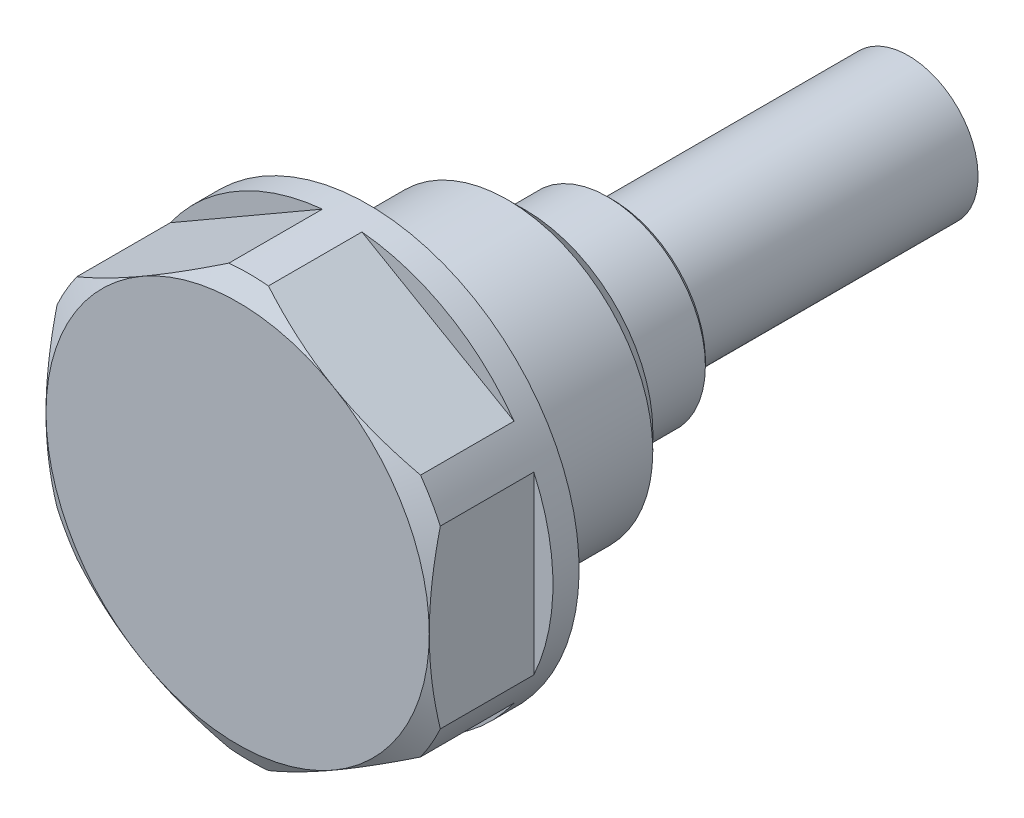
ISO-10303-21;
HEADER;
FILE_DESCRIPTION(('STEP AP214'),'2;1');
FILE_NAME('part.step','',(''),(''),'','','');
FILE_SCHEMA(('AUTOMOTIVE_DESIGN { 1 0 10303 214 1 1 1 1 }'));
ENDSEC;
DATA;
#1=APPLICATION_CONTEXT('core data for automotive mechanical design processes');
#2=APPLICATION_PROTOCOL_DEFINITION('international standard','automotive_design',2000,#1);
#3=PRODUCT_CONTEXT('',#1,'mechanical');
#4=PRODUCT('Part','Part','',(#3));
#5=PRODUCT_RELATED_PRODUCT_CATEGORY('part','',(#4));
#6=PRODUCT_DEFINITION_FORMATION('','',#4);
#7=PRODUCT_DEFINITION_CONTEXT('part definition',#1,'design');
#8=PRODUCT_DEFINITION('design','',#6,#7);
#9=PRODUCT_DEFINITION_SHAPE('','',#8);
#10=(LENGTH_UNIT() NAMED_UNIT(*) SI_UNIT(.MILLI.,.METRE.));
#11=(NAMED_UNIT(*) PLANE_ANGLE_UNIT() SI_UNIT($,.RADIAN.));
#12=(NAMED_UNIT(*) SI_UNIT($,.STERADIAN.) SOLID_ANGLE_UNIT());
#13=UNCERTAINTY_MEASURE_WITH_UNIT(LENGTH_MEASURE(1.E-05),#10,'distance_accuracy_value','');
#14=(GEOMETRIC_REPRESENTATION_CONTEXT(3) GLOBAL_UNCERTAINTY_ASSIGNED_CONTEXT((#13)) GLOBAL_UNIT_ASSIGNED_CONTEXT((#10,
#11,#12)) REPRESENTATION_CONTEXT('',''));
#15=CARTESIAN_POINT('',(0.,0.,0.));
#16=DIRECTION('',(0.,0.,1.));
#17=DIRECTION('',(1.,0.,0.));
#18=AXIS2_PLACEMENT_3D('',#15,#16,#17);
#19=CARTESIAN_POINT('',(0.,0.,8.));
#20=DIRECTION('',(0.,0.,-1.));
#21=DIRECTION('',(0.,-1.,0.));
#22=AXIS2_PLACEMENT_3D('',#19,#20,#21);
#23=CONICAL_SURFACE('',#22,11.,1.0471975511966);
#24=CARTESIAN_POINT('',(0.,0.,7.36491470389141));
#25=DIRECTION('',(0.,0.,-1.));
#26=DIRECTION('',(0.,-1.,0.));
#27=AXIS2_PLACEMENT_3D('',#24,#25,#26);
#28=CIRCLE('',#27,12.1);
#29=CARTESIAN_POINT('',(-1.13451033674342,12.0466960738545,7.36491470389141));
#30=VERTEX_POINT('',#29);
#31=CARTESIAN_POINT('',(1.13451033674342,12.0466960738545,7.36491470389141));
#32=VERTEX_POINT('',#31);
#33=EDGE_CURVE('E188',#30,#32,#28,.T.);
#34=ORIENTED_EDGE('',*,*,#33,.F.);
#35=CARTESIAN_POINT('',(-1.13379026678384,12.0471118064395,7.36471470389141));
#36=CARTESIAN_POINT('',(-1.36683789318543,11.9125616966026,7.42945478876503));
#37=CARTESIAN_POINT('',(-1.60075762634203,11.7775080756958,7.49014242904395));
#38=CARTESIAN_POINT('',(-2.07028066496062,11.5064288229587,7.60251944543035));
#39=CARTESIAN_POINT('',(-2.30588444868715,11.3704029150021,7.65420615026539));
#40=CARTESIAN_POINT('',(-2.77884702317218,11.0973378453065,7.7477019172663));
#41=CARTESIAN_POINT('',(-3.01620751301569,10.9602977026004,7.78949961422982));
#42=CARTESIAN_POINT('',(-3.49214988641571,10.6855122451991,7.86230459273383));
#43=CARTESIAN_POINT('',(-3.73073164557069,10.5477670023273,7.89331295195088));
#44=CARTESIAN_POINT('',(-4.20414239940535,10.2744431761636,7.94336759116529));
#45=CARTESIAN_POINT('',(-4.438953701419,10.1388748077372,7.96263563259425));
#46=CARTESIAN_POINT('',(-4.90908349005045,9.86744524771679,7.98970897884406));
#47=CARTESIAN_POINT('',(-5.14440199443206,9.73158404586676,7.99751387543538));
#48=CARTESIAN_POINT('',(-5.614933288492,9.45992267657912,8.0014728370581));
#49=CARTESIAN_POINT('',(-5.85014602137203,9.324122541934,7.99763580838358));
#50=CARTESIAN_POINT('',(-6.32019725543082,9.05273833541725,7.97842315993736));
#51=CARTESIAN_POINT('',(-6.55503578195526,8.91715424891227,7.96304835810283));
#52=CARTESIAN_POINT('',(-7.04733285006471,8.63292640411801,7.91902352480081));
#53=CARTESIAN_POINT('',(-7.30471283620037,8.48432799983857,7.88920300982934));
#54=CARTESIAN_POINT('',(-7.81813780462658,8.18790195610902,7.8168130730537));
#55=CARTESIAN_POINT('',(-8.07418265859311,8.04007439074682,7.77424244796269));
#56=CARTESIAN_POINT('',(-8.58741835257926,7.74375762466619,7.6768246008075));
#57=CARTESIAN_POINT('',(-8.84459036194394,7.59527929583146,7.6218463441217));
#58=CARTESIAN_POINT('',(-9.3569258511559,7.29948226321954,7.50108797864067));
#59=CARTESIAN_POINT('',(-9.61209008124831,7.15216312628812,7.43531212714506));
#60=CARTESIAN_POINT('',(-9.86620973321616,7.00544707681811,7.36471470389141));
#61=B_SPLINE_CURVE_WITH_KNOTS('',3,(#35,#36,#37,#38,#39,#40,#41,#42,#43,#44,#45,#46,#47,#48,#49,
#50,#51,#52,#53,#54,#55,#56,#57,#58,#59,#60),.UNSPECIFIED.,.F.,.F.,(4,2,2,2,2,2,2,2,2,2,2,2,4),
(0.,0.830349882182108,1.66094577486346,2.49249166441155,3.32395447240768,4.13918118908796,
4.95443693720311,5.76906915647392,6.58364363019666,7.47941283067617,8.37526659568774,
9.28106509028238,10.1865072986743),.UNSPECIFIED.);
#62=CARTESIAN_POINT('',(-5.5,9.52627944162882,8.));
#63=VERTEX_POINT('',#62);
#64=EDGE_CURVE('E291',#30,#63,#61,.T.);
#65=ORIENTED_EDGE('',*,*,#64,.T.);
#66=CARTESIAN_POINT('',(0.,0.,8.));
#67=DIRECTION('',(0.,0.,-1.));
#68=DIRECTION('',(0.,-1.,0.));
#69=AXIS2_PLACEMENT_3D('',#66,#67,#68);
#70=CIRCLE('',#69,11.);
#71=CARTESIAN_POINT('',(5.5,9.52627944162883,8.));
#72=VERTEX_POINT('',#71);
#73=EDGE_CURVE('E170',#63,#72,#70,.T.);
#74=ORIENTED_EDGE('',*,*,#73,.T.);
#75=CARTESIAN_POINT('',(9.86620973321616,7.00544707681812,7.36471470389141));
#76=CARTESIAN_POINT('',(9.63316210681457,7.13999718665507,7.42945478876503));
#77=CARTESIAN_POINT('',(9.39924237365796,7.2750508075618,7.49014242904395));
#78=CARTESIAN_POINT('',(8.92971933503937,7.54613006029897,7.60251944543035));
#79=CARTESIAN_POINT('',(8.69411555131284,7.68215596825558,7.65420615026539));
#80=CARTESIAN_POINT('',(8.22115297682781,7.95522103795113,7.7477019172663));
#81=CARTESIAN_POINT('',(7.98379248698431,8.09226118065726,7.78949961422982));
#82=CARTESIAN_POINT('',(7.50785011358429,8.36704663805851,7.86230459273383));
#83=CARTESIAN_POINT('',(7.2692683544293,8.50479188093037,7.89331295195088));
#84=CARTESIAN_POINT('',(6.79585760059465,8.77811570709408,7.94336759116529));
#85=CARTESIAN_POINT('',(6.56104629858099,8.91368407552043,7.96263563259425));
#86=CARTESIAN_POINT('',(6.09091650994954,9.18511363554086,7.98970897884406));
#87=CARTESIAN_POINT('',(5.85559800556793,9.32097483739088,7.99751387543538));
#88=CARTESIAN_POINT('',(5.385066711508,9.59263620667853,8.0014728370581));
#89=CARTESIAN_POINT('',(5.14985397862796,9.72843634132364,7.99763580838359));
#90=CARTESIAN_POINT('',(4.67980274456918,9.99982054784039,7.97842315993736));
#91=CARTESIAN_POINT('',(4.44496421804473,10.1354046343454,7.96304835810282));
#92=CARTESIAN_POINT('',(3.95266714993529,10.4196324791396,7.9190235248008));
#93=CARTESIAN_POINT('',(3.69528716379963,10.5682308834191,7.88920300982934));
#94=CARTESIAN_POINT('',(3.18186219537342,10.8646569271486,7.8168130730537));
#95=CARTESIAN_POINT('',(2.92581734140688,11.0124844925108,7.77424244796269));
#96=CARTESIAN_POINT('',(2.41258164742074,11.3088012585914,7.6768246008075));
#97=CARTESIAN_POINT('',(2.15540963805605,11.4572795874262,7.6218463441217));
#98=CARTESIAN_POINT('',(1.6430741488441,11.7530766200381,7.50108797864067));
#99=CARTESIAN_POINT('',(1.38790991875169,11.9003957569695,7.43531212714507));
#100=CARTESIAN_POINT('',(1.13379026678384,12.0471118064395,7.36471470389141));
#101=B_SPLINE_CURVE_WITH_KNOTS('',3,(#75,#76,#77,#78,#79,#80,#81,#82,#83,#84,#85,#86,#87,#88,
#89,#90,#91,#92,#93,#94,#95,#96,#97,#98,#99,#100),.UNSPECIFIED.,.F.,.F.,(4,2,2,2,2,2,2,2,2,2,2,
2,4),(0.,0.830349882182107,1.66094577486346,2.49249166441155,3.32395447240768,4.13918118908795,
4.95443693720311,5.76906915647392,6.58364363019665,7.47941283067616,8.37526659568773,
9.28106509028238,10.1865072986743),.UNSPECIFIED.);
#102=EDGE_CURVE('E193',#72,#32,#101,.T.);
#103=ORIENTED_EDGE('',*,*,#102,.T.);
#104=EDGE_LOOP('',(#34,#65,#74,#103));
#105=FACE_BOUND('',#104,.T.);
#106=ADVANCED_FACE('F14',(#105),#23,.T.);
#107=CARTESIAN_POINT('',(-5.5,-9.52627944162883,8.));
#108=VERTEX_POINT('',#107);
#109=CARTESIAN_POINT('',(-11.,0.,8.));
#110=VERTEX_POINT('',#109);
#111=EDGE_CURVE('E171',#108,#110,#70,.T.);
#112=ORIENTED_EDGE('',*,*,#111,.T.);
#113=CARTESIAN_POINT('',(-11.,-16.7952615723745,2.75946519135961));
#114=CARTESIAN_POINT('',(-11.,-16.5539758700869,2.87599914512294));
#115=CARTESIAN_POINT('',(-11.,-16.3123971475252,2.99192610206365));
#116=CARTESIAN_POINT('',(-11.,-15.8285917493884,3.22242657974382));
#117=CARTESIAN_POINT('',(-11.,-15.5863650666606,3.33700008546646));
#118=CARTESIAN_POINT('',(-11.,-14.8585484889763,3.67851482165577));
#119=CARTESIAN_POINT('',(-11.,-14.3719013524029,3.90321186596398));
#120=CARTESIAN_POINT('',(-11.,-13.3924182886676,4.3464571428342));
#121=CARTESIAN_POINT('',(-11.,-12.8995628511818,4.5649623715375));
#122=CARTESIAN_POINT('',(-11.,-11.9097841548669,4.99252162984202));
#123=CARTESIAN_POINT('',(-11.,-11.4128611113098,5.20157615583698));
#124=CARTESIAN_POINT('',(-11.,-10.408211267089,5.61010293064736));
#125=CARTESIAN_POINT('',(-11.,-9.90042619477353,5.80943267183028));
#126=CARTESIAN_POINT('',(-11.,-8.87885103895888,6.19236054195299));
#127=CARTESIAN_POINT('',(-11.,-8.36506029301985,6.37595691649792));
#128=CARTESIAN_POINT('',(-11.,-7.3317214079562,6.72244855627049));
#129=CARTESIAN_POINT('',(-11.,-6.81218833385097,6.88538825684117));
#130=CARTESIAN_POINT('',(-11.,-5.76575739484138,7.18524663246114));
#131=CARTESIAN_POINT('',(-11.,-5.23886192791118,7.32217357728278));
#132=CARTESIAN_POINT('',(-11.,-4.17723892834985,7.56332259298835));
#133=CARTESIAN_POINT('',(-11.,-3.64250876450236,7.66753340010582));
#134=CARTESIAN_POINT('',(-11.,-2.8357497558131,7.79406694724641));
#135=CARTESIAN_POINT('',(-11.,-2.56601974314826,7.83128373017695));
#136=CARTESIAN_POINT('',(-11.,-2.02531092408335,7.89505684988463));
#137=CARTESIAN_POINT('',(-11.,-1.75433223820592,7.9216141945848));
#138=CARTESIAN_POINT('',(-11.,-1.21318476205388,7.96335586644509));
#139=CARTESIAN_POINT('',(-11.,-0.943021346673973,7.9786095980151));
#140=CARTESIAN_POINT('',(-11.,-0.402291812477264,7.99766420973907));
#141=CARTESIAN_POINT('',(-11.,-0.13172569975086,8.00146526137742));
#142=CARTESIAN_POINT('',(-11.,0.409248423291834,7.99752416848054));
#143=CARTESIAN_POINT('',(-11.,0.679656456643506,7.98978522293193));
#144=CARTESIAN_POINT('',(-11.,1.21991254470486,7.962955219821));
#145=CARTESIAN_POINT('',(-11.,1.48976056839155,7.94386354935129));
#146=CARTESIAN_POINT('',(-11.,2.14514272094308,7.8841050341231));
#147=CARTESIAN_POINT('',(-11.,2.53016146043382,7.83767502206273));
#148=CARTESIAN_POINT('',(-11.,3.29715026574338,7.72430028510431));
#149=CARTESIAN_POINT('',(-11.,3.67911986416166,7.65735247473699));
#150=CARTESIAN_POINT('',(-11.,4.82113734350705,7.4290937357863));
#151=CARTESIAN_POINT('',(-11.,5.5757977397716,7.24052120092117));
#152=CARTESIAN_POINT('',(-11.,6.70454905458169,6.91577301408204));
#153=CARTESIAN_POINT('',(-11.,7.08454762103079,6.79896927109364));
#154=CARTESIAN_POINT('',(-11.,7.84087380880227,6.5538148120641));
#155=CARTESIAN_POINT('',(-11.,8.21720109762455,6.42546306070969));
#156=CARTESIAN_POINT('',(-11.,8.96430543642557,6.15995538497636));
#157=CARTESIAN_POINT('',(-11.,9.33510184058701,6.02285336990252));
#158=CARTESIAN_POINT('',(-11.,10.0735459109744,5.74077309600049));
#159=CARTESIAN_POINT('',(-11.,10.4411946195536,5.5957975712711));
#160=CARTESIAN_POINT('',(-11.,10.8075191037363,5.44762378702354));
#161=B_SPLINE_CURVE_WITH_KNOTS('',3,(#113,#114,#115,#116,#117,#118,#119,#120,#121,#122,#123,
#124,#125,#126,#127,#128,#129,#130,#131,#132,#133,#134,#135,#136,#137,#138,#139,#140,#141,#142,
#143,#144,#145,#146,#147,#148,#149,#150,#151,#152,#153,#154,#155,#156,#157,#158,#159,#160),
.UNSPECIFIED.,.F.,.F.,(4,2,2,2,2,2,2,2,2,2,2,2,2,2,2,2,2,2,2,2,2,2,2,4),(0.,0.80385822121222,
1.60772535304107,3.21572389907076,4.83300876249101,6.45020857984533,8.08652788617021,
9.72302941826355,11.355948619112,12.9883478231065,14.6213084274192,15.4379871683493,
16.2545886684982,17.0661337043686,17.8776665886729,18.6889745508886,19.5003263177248,
20.6630891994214,21.8260270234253,24.1563947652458,25.3489384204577,26.5415890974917,
27.7274933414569,28.9129883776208),.UNSPECIFIED.);
#162=CARTESIAN_POINT('',(-11.,-5.04083326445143,7.36491470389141));
#163=VERTEX_POINT('',#162);
#164=EDGE_CURVE('E278',#110,#163,#161,.F.);
#165=ORIENTED_EDGE('',*,*,#164,.T.);
#166=CARTESIAN_POINT('',(-9.86548966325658,-7.00586280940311,7.36491470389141));
#167=VERTEX_POINT('',#166);
#168=EDGE_CURVE('E347',#167,#163,#28,.T.);
#169=ORIENTED_EDGE('',*,*,#168,.F.);
#170=CARTESIAN_POINT('',(-9.86620973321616,-7.00544707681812,7.36471470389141));
#171=CARTESIAN_POINT('',(-9.63316210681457,-7.13999718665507,7.42945478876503));
#172=CARTESIAN_POINT('',(-9.39924237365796,-7.2750508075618,7.49014242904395));
#173=CARTESIAN_POINT('',(-8.92971933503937,-7.54613006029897,7.60251944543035));
#174=CARTESIAN_POINT('',(-8.69411555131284,-7.68215596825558,7.65420615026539));
#175=CARTESIAN_POINT('',(-8.22115297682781,-7.95522103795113,7.7477019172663));
#176=CARTESIAN_POINT('',(-7.98379248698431,-8.09226118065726,7.78949961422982));
#177=CARTESIAN_POINT('',(-7.50785011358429,-8.36704663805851,7.86230459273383));
#178=CARTESIAN_POINT('',(-7.2692683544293,-8.50479188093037,7.89331295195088));
#179=CARTESIAN_POINT('',(-6.79585760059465,-8.77811570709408,7.94336759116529));
#180=CARTESIAN_POINT('',(-6.56104629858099,-8.91368407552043,7.96263563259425));
#181=CARTESIAN_POINT('',(-6.09091650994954,-9.18511363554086,7.98970897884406));
#182=CARTESIAN_POINT('',(-5.85559800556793,-9.32097483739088,7.99751387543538));
#183=CARTESIAN_POINT('',(-5.385066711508,-9.59263620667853,8.0014728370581));
#184=CARTESIAN_POINT('',(-5.14985397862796,-9.72843634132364,7.99763580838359));
#185=CARTESIAN_POINT('',(-4.67980274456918,-9.99982054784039,7.97842315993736));
#186=CARTESIAN_POINT('',(-4.44496421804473,-10.1354046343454,7.96304835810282));
#187=CARTESIAN_POINT('',(-3.95266714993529,-10.4196324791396,7.9190235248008));
#188=CARTESIAN_POINT('',(-3.69528716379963,-10.5682308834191,7.88920300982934));
#189=CARTESIAN_POINT('',(-3.18186219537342,-10.8646569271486,7.8168130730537));
#190=CARTESIAN_POINT('',(-2.92581734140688,-11.0124844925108,7.77424244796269));
#191=CARTESIAN_POINT('',(-2.41258164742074,-11.3088012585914,7.6768246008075));
#192=CARTESIAN_POINT('',(-2.15540963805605,-11.4572795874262,7.6218463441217));
#193=CARTESIAN_POINT('',(-1.6430741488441,-11.7530766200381,7.50108797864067));
#194=CARTESIAN_POINT('',(-1.38790991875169,-11.9003957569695,7.43531212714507));
#195=CARTESIAN_POINT('',(-1.13379026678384,-12.0471118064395,7.36471470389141));
#196=B_SPLINE_CURVE_WITH_KNOTS('',3,(#170,#171,#172,#173,#174,#175,#176,#177,#178,#179,#180,
#181,#182,#183,#184,#185,#186,#187,#188,#189,#190,#191,#192,#193,#194,#195),.UNSPECIFIED.,.F.,
.F.,(4,2,2,2,2,2,2,2,2,2,2,2,4),(0.,0.830349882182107,1.66094577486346,2.49249166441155,
3.32395447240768,4.13918118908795,4.95443693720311,5.76906915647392,6.58364363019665,
7.47941283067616,8.37526659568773,9.28106509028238,10.1865072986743),.UNSPECIFIED.);
#197=EDGE_CURVE('E279',#167,#108,#196,.T.);
#198=ORIENTED_EDGE('',*,*,#197,.T.);
#199=EDGE_LOOP('',(#112,#165,#169,#198));
#200=FACE_BOUND('',#199,.T.);
#201=ADVANCED_FACE('F262',(#200),#23,.T.);
#202=CARTESIAN_POINT('',(5.5,-9.52627944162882,8.));
#203=VERTEX_POINT('',#202);
#204=EDGE_CURVE('E283',#203,#108,#70,.T.);
#205=ORIENTED_EDGE('',*,*,#204,.T.);
#206=CARTESIAN_POINT('',(-1.13451033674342,-12.0466960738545,7.36491470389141));
#207=VERTEX_POINT('',#206);
#208=EDGE_CURVE('E289',#108,#207,#196,.T.);
#209=ORIENTED_EDGE('',*,*,#208,.T.);
#210=CARTESIAN_POINT('',(1.13451033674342,-12.0466960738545,7.36491470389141));
#211=VERTEX_POINT('',#210);
#212=EDGE_CURVE('E346',#211,#207,#28,.T.);
#213=ORIENTED_EDGE('',*,*,#212,.F.);
#214=CARTESIAN_POINT('',(1.13379026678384,-12.0471118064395,7.36471470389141));
#215=CARTESIAN_POINT('',(1.36683789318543,-11.9125616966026,7.42945478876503));
#216=CARTESIAN_POINT('',(1.60075762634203,-11.7775080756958,7.49014242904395));
#217=CARTESIAN_POINT('',(2.07028066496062,-11.5064288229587,7.60251944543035));
#218=CARTESIAN_POINT('',(2.30588444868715,-11.3704029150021,7.65420615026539));
#219=CARTESIAN_POINT('',(2.77884702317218,-11.0973378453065,7.7477019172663));
#220=CARTESIAN_POINT('',(3.01620751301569,-10.9602977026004,7.78949961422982));
#221=CARTESIAN_POINT('',(3.49214988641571,-10.6855122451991,7.86230459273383));
#222=CARTESIAN_POINT('',(3.73073164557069,-10.5477670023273,7.89331295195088));
#223=CARTESIAN_POINT('',(4.20414239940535,-10.2744431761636,7.94336759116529));
#224=CARTESIAN_POINT('',(4.438953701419,-10.1388748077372,7.96263563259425));
#225=CARTESIAN_POINT('',(4.90908349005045,-9.86744524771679,7.98970897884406));
#226=CARTESIAN_POINT('',(5.14440199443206,-9.73158404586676,7.99751387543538));
#227=CARTESIAN_POINT('',(5.614933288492,-9.45992267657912,8.0014728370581));
#228=CARTESIAN_POINT('',(5.85014602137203,-9.324122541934,7.99763580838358));
#229=CARTESIAN_POINT('',(6.32019725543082,-9.05273833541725,7.97842315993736));
#230=CARTESIAN_POINT('',(6.55503578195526,-8.91715424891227,7.96304835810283));
#231=CARTESIAN_POINT('',(7.04733285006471,-8.63292640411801,7.91902352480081));
#232=CARTESIAN_POINT('',(7.30471283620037,-8.48432799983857,7.88920300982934));
#233=CARTESIAN_POINT('',(7.81813780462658,-8.18790195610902,7.8168130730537));
#234=CARTESIAN_POINT('',(8.07418265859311,-8.04007439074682,7.77424244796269));
#235=CARTESIAN_POINT('',(8.58741835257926,-7.74375762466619,7.6768246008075));
#236=CARTESIAN_POINT('',(8.84459036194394,-7.59527929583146,7.6218463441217));
#237=CARTESIAN_POINT('',(9.3569258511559,-7.29948226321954,7.50108797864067));
#238=CARTESIAN_POINT('',(9.61209008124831,-7.15216312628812,7.43531212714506));
#239=CARTESIAN_POINT('',(9.86620973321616,-7.00544707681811,7.36471470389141));
#240=B_SPLINE_CURVE_WITH_KNOTS('',3,(#214,#215,#216,#217,#218,#219,#220,#221,#222,#223,#224,
#225,#226,#227,#228,#229,#230,#231,#232,#233,#234,#235,#236,#237,#238,#239),.UNSPECIFIED.,.F.,
.F.,(4,2,2,2,2,2,2,2,2,2,2,2,4),(0.,0.830349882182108,1.66094577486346,2.49249166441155,
3.32395447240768,4.13918118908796,4.95443693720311,5.76906915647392,6.58364363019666,
7.47941283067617,8.37526659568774,9.28106509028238,10.1865072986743),.UNSPECIFIED.);
#241=EDGE_CURVE('E327',#211,#203,#240,.T.);
#242=ORIENTED_EDGE('',*,*,#241,.T.);
#243=EDGE_LOOP('',(#205,#209,#213,#242));
#244=FACE_BOUND('',#243,.T.);
#245=ADVANCED_FACE('F266',(#244),#23,.T.);
#246=CARTESIAN_POINT('',(11.,0.,8.));
#247=VERTEX_POINT('',#246);
#248=EDGE_CURVE('E459',#247,#203,#70,.T.);
#249=ORIENTED_EDGE('',*,*,#248,.T.);
#250=CARTESIAN_POINT('',(9.86548966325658,-7.00586280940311,7.36491470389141));
#251=VERTEX_POINT('',#250);
#252=EDGE_CURVE('E333',#203,#251,#240,.T.);
#253=ORIENTED_EDGE('',*,*,#252,.T.);
#254=CARTESIAN_POINT('',(11.,-5.04083326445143,7.36491470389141));
#255=VERTEX_POINT('',#254);
#256=EDGE_CURVE('E343',#255,#251,#28,.T.);
#257=ORIENTED_EDGE('',*,*,#256,.F.);
#258=CARTESIAN_POINT('',(11.,-16.7952615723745,2.75946519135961));
#259=CARTESIAN_POINT('',(11.,-16.5539758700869,2.87599914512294));
#260=CARTESIAN_POINT('',(11.,-16.3123971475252,2.99192610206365));
#261=CARTESIAN_POINT('',(11.,-15.8285917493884,3.22242657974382));
#262=CARTESIAN_POINT('',(11.,-15.5863650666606,3.33700008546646));
#263=CARTESIAN_POINT('',(11.,-14.8585484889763,3.67851482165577));
#264=CARTESIAN_POINT('',(11.,-14.3719013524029,3.90321186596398));
#265=CARTESIAN_POINT('',(11.,-13.3924182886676,4.3464571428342));
#266=CARTESIAN_POINT('',(11.,-12.8995628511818,4.5649623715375));
#267=CARTESIAN_POINT('',(11.,-11.9097841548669,4.99252162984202));
#268=CARTESIAN_POINT('',(11.,-11.4128611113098,5.20157615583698));
#269=CARTESIAN_POINT('',(11.,-10.408211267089,5.61010293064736));
#270=CARTESIAN_POINT('',(11.,-9.90042619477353,5.80943267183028));
#271=CARTESIAN_POINT('',(11.,-8.87885103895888,6.19236054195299));
#272=CARTESIAN_POINT('',(11.,-8.36506029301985,6.37595691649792));
#273=CARTESIAN_POINT('',(11.,-7.3317214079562,6.72244855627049));
#274=CARTESIAN_POINT('',(11.,-6.81218833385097,6.88538825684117));
#275=CARTESIAN_POINT('',(11.,-5.76575739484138,7.18524663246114));
#276=CARTESIAN_POINT('',(11.,-5.23886192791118,7.32217357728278));
#277=CARTESIAN_POINT('',(11.,-4.17723892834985,7.56332259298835));
#278=CARTESIAN_POINT('',(11.,-3.64250876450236,7.66753340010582));
#279=CARTESIAN_POINT('',(11.,-2.8357497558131,7.79406694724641));
#280=CARTESIAN_POINT('',(11.,-2.56601974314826,7.83128373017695));
#281=CARTESIAN_POINT('',(11.,-2.02531092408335,7.89505684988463));
#282=CARTESIAN_POINT('',(11.,-1.75433223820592,7.9216141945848));
#283=CARTESIAN_POINT('',(11.,-1.21318476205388,7.96335586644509));
#284=CARTESIAN_POINT('',(11.,-0.943021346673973,7.9786095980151));
#285=CARTESIAN_POINT('',(11.,-0.402291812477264,7.99766420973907));
#286=CARTESIAN_POINT('',(11.,-0.13172569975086,8.00146526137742));
#287=CARTESIAN_POINT('',(11.,0.409248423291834,7.99752416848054));
#288=CARTESIAN_POINT('',(11.,0.679656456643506,7.98978522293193));
#289=CARTESIAN_POINT('',(11.,1.21991254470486,7.962955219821));
#290=CARTESIAN_POINT('',(11.,1.48976056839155,7.94386354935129));
#291=CARTESIAN_POINT('',(11.,2.14514272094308,7.8841050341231));
#292=CARTESIAN_POINT('',(11.,2.53016146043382,7.83767502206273));
#293=CARTESIAN_POINT('',(11.,3.29715026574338,7.72430028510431));
#294=CARTESIAN_POINT('',(11.,3.67911986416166,7.65735247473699));
#295=CARTESIAN_POINT('',(11.,4.82113734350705,7.4290937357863));
#296=CARTESIAN_POINT('',(11.,5.5757977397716,7.24052120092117));
#297=CARTESIAN_POINT('',(11.,6.70454905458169,6.91577301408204));
#298=CARTESIAN_POINT('',(11.,7.08454762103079,6.79896927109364));
#299=CARTESIAN_POINT('',(11.,7.84087380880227,6.5538148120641));
#300=CARTESIAN_POINT('',(11.,8.21720109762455,6.42546306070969));
#301=CARTESIAN_POINT('',(11.,8.96430543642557,6.15995538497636));
#302=CARTESIAN_POINT('',(11.,9.33510184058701,6.02285336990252));
#303=CARTESIAN_POINT('',(11.,10.0735459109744,5.74077309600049));
#304=CARTESIAN_POINT('',(11.,10.4411946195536,5.5957975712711));
#305=CARTESIAN_POINT('',(11.,10.8075191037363,5.44762378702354));
#306=B_SPLINE_CURVE_WITH_KNOTS('',3,(#258,#259,#260,#261,#262,#263,#264,#265,#266,#267,#268,
#269,#270,#271,#272,#273,#274,#275,#276,#277,#278,#279,#280,#281,#282,#283,#284,#285,#286,#287,
#288,#289,#290,#291,#292,#293,#294,#295,#296,#297,#298,#299,#300,#301,#302,#303,#304,#305),
.UNSPECIFIED.,.F.,.F.,(4,2,2,2,2,2,2,2,2,2,2,2,2,2,2,2,2,2,2,2,2,2,2,4),(0.,0.80385822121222,
1.60772535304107,3.21572389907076,4.83300876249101,6.45020857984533,8.08652788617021,
9.72302941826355,11.355948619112,12.9883478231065,14.6213084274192,15.4379871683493,
16.2545886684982,17.0661337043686,17.8776665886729,18.6889745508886,19.5003263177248,
20.6630891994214,21.8260270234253,24.1563947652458,25.3489384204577,26.5415890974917,
27.7274933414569,28.9129883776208),.UNSPECIFIED.);
#307=EDGE_CURVE('E201',#255,#247,#306,.T.);
#308=ORIENTED_EDGE('',*,*,#307,.T.);
#309=EDGE_LOOP('',(#249,#253,#257,#308));
#310=FACE_BOUND('',#309,.T.);
#311=ADVANCED_FACE('F271',(#310),#23,.T.);
#312=EDGE_CURVE('E341',#72,#247,#70,.T.);
#313=ORIENTED_EDGE('',*,*,#312,.T.);
#314=CARTESIAN_POINT('',(11.,5.04083326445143,7.36491470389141));
#315=VERTEX_POINT('',#314);
#316=EDGE_CURVE('E204',#247,#315,#306,.T.);
#317=ORIENTED_EDGE('',*,*,#316,.T.);
#318=CARTESIAN_POINT('',(9.86548966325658,7.00586280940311,7.36491470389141));
#319=VERTEX_POINT('',#318);
#320=EDGE_CURVE('E340',#319,#315,#28,.T.);
#321=ORIENTED_EDGE('',*,*,#320,.F.);
#322=EDGE_CURVE('E137',#319,#72,#101,.T.);
#323=ORIENTED_EDGE('',*,*,#322,.T.);
#324=EDGE_LOOP('',(#313,#317,#321,#323));
#325=FACE_BOUND('',#324,.T.);
#326=ADVANCED_FACE('F259',(#325),#23,.T.);
#327=CARTESIAN_POINT('',(0.,0.,8.));
#328=DIRECTION('',(0.,0.,-1.));
#329=DIRECTION('',(0.,-1.,0.));
#330=AXIS2_PLACEMENT_3D('',#327,#328,#329);
#331=PLANE('',#330);
#332=EDGE_CURVE('E164',#110,#63,#70,.T.);
#333=ORIENTED_EDGE('',*,*,#332,.F.);
#334=ORIENTED_EDGE('',*,*,#111,.F.);
#335=ORIENTED_EDGE('',*,*,#204,.F.);
#336=ORIENTED_EDGE('',*,*,#248,.F.);
#337=ORIENTED_EDGE('',*,*,#312,.F.);
#338=ORIENTED_EDGE('',*,*,#73,.F.);
#339=EDGE_LOOP('',(#333,#334,#335,#336,#337,#338));
#340=FACE_BOUND('',#339,.T.);
#341=ADVANCED_FACE('F16',(#340),#331,.F.);
#342=ORIENTED_EDGE('',*,*,#332,.T.);
#343=CARTESIAN_POINT('',(-9.86548966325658,7.00586280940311,7.36491470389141));
#344=VERTEX_POINT('',#343);
#345=EDGE_CURVE('E286',#63,#344,#61,.T.);
#346=ORIENTED_EDGE('',*,*,#345,.T.);
#347=CARTESIAN_POINT('',(-11.,5.04083326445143,7.36491470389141));
#348=VERTEX_POINT('',#347);
#349=EDGE_CURVE('E144',#348,#344,#28,.T.);
#350=ORIENTED_EDGE('',*,*,#349,.F.);
#351=EDGE_CURVE('E287',#348,#110,#161,.F.);
#352=ORIENTED_EDGE('',*,*,#351,.T.);
#353=EDGE_LOOP('',(#342,#346,#350,#352));
#354=FACE_BOUND('',#353,.T.);
#355=ADVANCED_FACE('F218',(#354),#23,.T.);
#356=CARTESIAN_POINT('',(0.,0.,-30.5));
#357=DIRECTION('',(0.,0.,-1.));
#358=DIRECTION('',(0.,-1.,0.));
#359=AXIS2_PLACEMENT_3D('',#356,#357,#358);
#360=CYLINDRICAL_SURFACE('',#359,12.1);
#361=CARTESIAN_POINT('',(0.,0.,0.5));
#362=DIRECTION('',(0.,0.,-1.));
#363=DIRECTION('',(0.,-1.,0.));
#364=AXIS2_PLACEMENT_3D('',#361,#362,#363);
#365=CIRCLE('',#364,12.1);
#366=CARTESIAN_POINT('',(0.,-12.1,0.5));
#367=VERTEX_POINT('',#366);
#368=EDGE_CURVE('E349',#367,#367,#365,.T.);
#369=ORIENTED_EDGE('',*,*,#368,.F.);
#370=EDGE_LOOP('',(#369));
#371=FACE_BOUND('',#370,.T.);
#372=ORIENTED_EDGE('',*,*,#212,.T.);
#373=DIRECTION('',(0.,0.,-1.));
#374=VECTOR('',#373,1.);
#375=CARTESIAN_POINT('',(-1.13451033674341,-12.0466960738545,-30.5));
#376=LINE('',#375,#374);
#377=CARTESIAN_POINT('',(-1.13451033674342,-12.0466960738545,2.));
#378=VERTEX_POINT('',#377);
#379=EDGE_CURVE('E9',#207,#378,#376,.T.);
#380=ORIENTED_EDGE('',*,*,#379,.T.);
#381=CARTESIAN_POINT('',(0.,0.,2.));
#382=DIRECTION('',(0.,0.,-1.));
#383=DIRECTION('',(0.,-1.,0.));
#384=AXIS2_PLACEMENT_3D('',#381,#382,#383);
#385=CIRCLE('',#384,12.1);
#386=CARTESIAN_POINT('',(-9.86548966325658,-7.00586280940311,2.));
#387=VERTEX_POINT('',#386);
#388=EDGE_CURVE('E148',#378,#387,#385,.T.);
#389=ORIENTED_EDGE('',*,*,#388,.T.);
#390=DIRECTION('',(0.,0.,-1.));
#391=VECTOR('',#390,1.);
#392=CARTESIAN_POINT('',(-9.86548966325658,-7.00586280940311,-30.5));
#393=LINE('',#392,#391);
#394=EDGE_CURVE('E22',#387,#167,#393,.F.);
#395=ORIENTED_EDGE('',*,*,#394,.T.);
#396=ORIENTED_EDGE('',*,*,#168,.T.);
#397=DIRECTION('',(0.,0.,-1.));
#398=VECTOR('',#397,1.);
#399=CARTESIAN_POINT('',(-11.,-5.04083326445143,-30.5));
#400=LINE('',#399,#398);
#401=CARTESIAN_POINT('',(-11.,-5.04083326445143,2.));
#402=VERTEX_POINT('',#401);
#403=EDGE_CURVE('E153',#163,#402,#400,.T.);
#404=ORIENTED_EDGE('',*,*,#403,.T.);
#405=CARTESIAN_POINT('',(-11.,5.04083326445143,2.));
#406=VERTEX_POINT('',#405);
#407=EDGE_CURVE('E132',#402,#406,#385,.T.);
#408=ORIENTED_EDGE('',*,*,#407,.T.);
#409=DIRECTION('',(0.,0.,-1.));
#410=VECTOR('',#409,1.);
#411=CARTESIAN_POINT('',(-11.,5.04083326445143,-30.5));
#412=LINE('',#411,#410);
#413=EDGE_CURVE('E147',#406,#348,#412,.F.);
#414=ORIENTED_EDGE('',*,*,#413,.T.);
#415=ORIENTED_EDGE('',*,*,#349,.T.);
#416=DIRECTION('',(0.,0.,-1.));
#417=VECTOR('',#416,1.);
#418=CARTESIAN_POINT('',(-9.86548966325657,7.00586280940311,-30.5));
#419=LINE('',#418,#417);
#420=CARTESIAN_POINT('',(-9.86548966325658,7.0058628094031,2.));
#421=VERTEX_POINT('',#420);
#422=EDGE_CURVE('E135',#344,#421,#419,.T.);
#423=ORIENTED_EDGE('',*,*,#422,.T.);
#424=CARTESIAN_POINT('',(-1.13451033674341,12.0466960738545,2.));
#425=VERTEX_POINT('',#424);
#426=EDGE_CURVE('E120',#421,#425,#385,.T.);
#427=ORIENTED_EDGE('',*,*,#426,.T.);
#428=DIRECTION('',(0.,0.,-1.));
#429=VECTOR('',#428,1.);
#430=CARTESIAN_POINT('',(-1.13451033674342,12.0466960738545,-30.5));
#431=LINE('',#430,#429);
#432=EDGE_CURVE('E128',#425,#30,#431,.F.);
#433=ORIENTED_EDGE('',*,*,#432,.T.);
#434=ORIENTED_EDGE('',*,*,#33,.T.);
#435=DIRECTION('',(0.,0.,-1.));
#436=VECTOR('',#435,1.);
#437=CARTESIAN_POINT('',(1.13451033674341,12.0466960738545,-30.5));
#438=LINE('',#437,#436);
#439=CARTESIAN_POINT('',(1.13451033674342,12.0466960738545,2.));
#440=VERTEX_POINT('',#439);
#441=EDGE_CURVE('E129',#32,#440,#438,.T.);
#442=ORIENTED_EDGE('',*,*,#441,.T.);
#443=CARTESIAN_POINT('',(9.86548966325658,7.00586280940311,2.));
#444=VERTEX_POINT('',#443);
#445=EDGE_CURVE('E131',#440,#444,#385,.T.);
#446=ORIENTED_EDGE('',*,*,#445,.T.);
#447=DIRECTION('',(0.,0.,-1.));
#448=VECTOR('',#447,1.);
#449=CARTESIAN_POINT('',(9.86548966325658,7.00586280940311,-30.5));
#450=LINE('',#449,#448);
#451=EDGE_CURVE('E180',#444,#319,#450,.F.);
#452=ORIENTED_EDGE('',*,*,#451,.T.);
#453=ORIENTED_EDGE('',*,*,#320,.T.);
#454=DIRECTION('',(0.,0.,-1.));
#455=VECTOR('',#454,1.);
#456=CARTESIAN_POINT('',(11.,5.04083326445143,-30.5));
#457=LINE('',#456,#455);
#458=CARTESIAN_POINT('',(11.,5.04083326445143,2.));
#459=VERTEX_POINT('',#458);
#460=EDGE_CURVE('E176',#315,#459,#457,.T.);
#461=ORIENTED_EDGE('',*,*,#460,.T.);
#462=CARTESIAN_POINT('',(11.,-5.04083326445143,2.));
#463=VERTEX_POINT('',#462);
#464=EDGE_CURVE('E165',#459,#463,#385,.T.);
#465=ORIENTED_EDGE('',*,*,#464,.T.);
#466=DIRECTION('',(0.,0.,-1.));
#467=VECTOR('',#466,1.);
#468=CARTESIAN_POINT('',(11.,-5.04083326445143,-30.5));
#469=LINE('',#468,#467);
#470=EDGE_CURVE('E173',#463,#255,#469,.F.);
#471=ORIENTED_EDGE('',*,*,#470,.T.);
#472=ORIENTED_EDGE('',*,*,#256,.T.);
#473=DIRECTION('',(0.,0.,-1.));
#474=VECTOR('',#473,1.);
#475=CARTESIAN_POINT('',(9.86548966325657,-7.00586280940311,-30.5));
#476=LINE('',#475,#474);
#477=CARTESIAN_POINT('',(9.86548966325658,-7.0058628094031,2.));
#478=VERTEX_POINT('',#477);
#479=EDGE_CURVE('E168',#251,#478,#476,.T.);
#480=ORIENTED_EDGE('',*,*,#479,.T.);
#481=CARTESIAN_POINT('',(1.13451033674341,-12.0466960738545,2.));
#482=VERTEX_POINT('',#481);
#483=EDGE_CURVE('E159',#478,#482,#385,.T.);
#484=ORIENTED_EDGE('',*,*,#483,.T.);
#485=DIRECTION('',(0.,0.,-1.));
#486=VECTOR('',#485,1.);
#487=CARTESIAN_POINT('',(1.13451033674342,-12.0466960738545,-30.5));
#488=LINE('',#487,#486);
#489=EDGE_CURVE('E163',#482,#211,#488,.F.);
#490=ORIENTED_EDGE('',*,*,#489,.T.);
#491=EDGE_LOOP('',(#372,#380,#389,#395,#396,#404,#408,#414,#415,#423,#427,#433,#434,#442,#446,
#452,#453,#461,#465,#471,#472,#480,#484,#490));
#492=FACE_BOUND('',#491,.T.);
#493=ADVANCED_FACE('F141',(#371,#492),#360,.T.);
#494=CARTESIAN_POINT('',(-12.1,0.,0.5));
#495=DIRECTION('',(0.,0.,1.));
#496=DIRECTION('',(0.,1.,0.));
#497=AXIS2_PLACEMENT_3D('',#494,#495,#496);
#498=PLANE('',#497);
#499=CARTESIAN_POINT('',(0.,0.,0.5));
#500=DIRECTION('',(0.,0.,-1.));
#501=DIRECTION('',(0.,-1.,0.));
#502=AXIS2_PLACEMENT_3D('',#499,#500,#501);
#503=CIRCLE('',#502,9.06433333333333);
#504=CARTESIAN_POINT('',(0.,-9.06433333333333,0.5));
#505=VERTEX_POINT('',#504);
#506=EDGE_CURVE('E352',#505,#505,#503,.T.);
#507=ORIENTED_EDGE('',*,*,#506,.F.);
#508=EDGE_LOOP('',(#507));
#509=FACE_BOUND('',#508,.T.);
#510=ORIENTED_EDGE('',*,*,#368,.T.);
#511=EDGE_LOOP('',(#510));
#512=FACE_BOUND('',#511,.T.);
#513=ADVANCED_FACE('F248',(#509,#512),#498,.F.);
#514=CARTESIAN_POINT('',(0.,0.,-30.5));
#515=DIRECTION('',(0.,0.,-1.));
#516=DIRECTION('',(0.,-1.,0.));
#517=AXIS2_PLACEMENT_3D('',#514,#515,#516);
#518=CYLINDRICAL_SURFACE('',#517,9.06433333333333);
#519=CARTESIAN_POINT('',(0.,0.,0.));
#520=DIRECTION('',(0.,0.,-1.));
#521=DIRECTION('',(0.,-1.,0.));
#522=AXIS2_PLACEMENT_3D('',#519,#520,#521);
#523=CIRCLE('',#522,9.06433333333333);
#524=CARTESIAN_POINT('',(0.,-9.06433333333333,0.));
#525=VERTEX_POINT('',#524);
#526=EDGE_CURVE('E355',#525,#525,#523,.T.);
#527=ORIENTED_EDGE('',*,*,#526,.F.);
#528=EDGE_LOOP('',(#527));
#529=FACE_BOUND('',#528,.T.);
#530=ORIENTED_EDGE('',*,*,#506,.T.);
#531=EDGE_LOOP('',(#530));
#532=FACE_BOUND('',#531,.T.);
#533=ADVANCED_FACE('F244',(#529,#532),#518,.T.);
#534=CARTESIAN_POINT('',(-9.06433333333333,0.,0.));
#535=DIRECTION('',(0.,0.,1.));
#536=DIRECTION('',(0.,1.,0.));
#537=AXIS2_PLACEMENT_3D('',#534,#535,#536);
#538=PLANE('',#537);
#539=CARTESIAN_POINT('',(0.,0.,0.));
#540=DIRECTION('',(0.,0.,-1.));
#541=DIRECTION('',(0.,-1.,0.));
#542=AXIS2_PLACEMENT_3D('',#539,#540,#541);
#543=CIRCLE('',#542,8.331);
#544=CARTESIAN_POINT('',(0.,-8.331,0.));
#545=VERTEX_POINT('',#544);
#546=EDGE_CURVE('E358',#545,#545,#543,.T.);
#547=ORIENTED_EDGE('',*,*,#546,.F.);
#548=EDGE_LOOP('',(#547));
#549=FACE_BOUND('',#548,.T.);
#550=ORIENTED_EDGE('',*,*,#526,.T.);
#551=EDGE_LOOP('',(#550));
#552=FACE_BOUND('',#551,.T.);
#553=ADVANCED_FACE('F240',(#549,#552),#538,.F.);
#554=CARTESIAN_POINT('',(0.,0.,-30.5));
#555=DIRECTION('',(0.,0.,-1.));
#556=DIRECTION('',(0.,-1.,0.));
#557=AXIS2_PLACEMENT_3D('',#554,#555,#556);
#558=CYLINDRICAL_SURFACE('',#557,8.331);
#559=CARTESIAN_POINT('',(0.,0.,0.5));
#560=DIRECTION('',(0.,0.,-1.));
#561=DIRECTION('',(0.,-1.,0.));
#562=AXIS2_PLACEMENT_3D('',#559,#560,#561);
#563=CIRCLE('',#562,8.331);
#564=CARTESIAN_POINT('',(0.,-8.331,0.5));
#565=VERTEX_POINT('',#564);
#566=EDGE_CURVE('E361',#565,#565,#563,.T.);
#567=ORIENTED_EDGE('',*,*,#566,.F.);
#568=EDGE_LOOP('',(#567));
#569=FACE_BOUND('',#568,.T.);
#570=ORIENTED_EDGE('',*,*,#546,.T.);
#571=EDGE_LOOP('',(#570));
#572=FACE_BOUND('',#571,.T.);
#573=ADVANCED_FACE('F236',(#569,#572),#558,.F.);
#574=CARTESIAN_POINT('',(-8.331,0.,0.5));
#575=DIRECTION('',(0.,0.,1.));
#576=DIRECTION('',(0.,1.,0.));
#577=AXIS2_PLACEMENT_3D('',#574,#575,#576);
#578=PLANE('',#577);
#579=CARTESIAN_POINT('',(0.,0.,0.5));
#580=DIRECTION('',(0.,0.,-1.));
#581=DIRECTION('',(0.,-1.,0.));
#582=AXIS2_PLACEMENT_3D('',#579,#580,#581);
#583=CIRCLE('',#582,6.6648);
#584=CARTESIAN_POINT('',(0.,-6.6648,0.5));
#585=VERTEX_POINT('',#584);
#586=EDGE_CURVE('E364',#585,#585,#583,.T.);
#587=ORIENTED_EDGE('',*,*,#586,.F.);
#588=EDGE_LOOP('',(#587));
#589=FACE_BOUND('',#588,.T.);
#590=ORIENTED_EDGE('',*,*,#566,.T.);
#591=EDGE_LOOP('',(#590));
#592=FACE_BOUND('',#591,.T.);
#593=ADVANCED_FACE('F232',(#589,#592),#578,.F.);
#594=CARTESIAN_POINT('',(0.,0.,-30.5));
#595=DIRECTION('',(0.,0.,-1.));
#596=DIRECTION('',(0.,-1.,0.));
#597=AXIS2_PLACEMENT_3D('',#594,#595,#596);
#598=CYLINDRICAL_SURFACE('',#597,6.6648);
#599=CARTESIAN_POINT('',(0.,0.,-0.5));
#600=DIRECTION('',(0.,0.,-1.));
#601=DIRECTION('',(0.,-1.,0.));
#602=AXIS2_PLACEMENT_3D('',#599,#600,#601);
#603=CIRCLE('',#602,6.6648);
#604=CARTESIAN_POINT('',(0.,-6.6648,-0.5));
#605=VERTEX_POINT('',#604);
#606=EDGE_CURVE('E366',#605,#605,#603,.T.);
#607=ORIENTED_EDGE('',*,*,#606,.F.);
#608=EDGE_LOOP('',(#607));
#609=FACE_BOUND('',#608,.T.);
#610=ORIENTED_EDGE('',*,*,#586,.T.);
#611=EDGE_LOOP('',(#610));
#612=FACE_BOUND('',#611,.T.);
#613=ADVANCED_FACE('F228',(#609,#612),#598,.T.);
#614=CARTESIAN_POINT('',(0.,0.,2.));
#615=DIRECTION('',(0.,0.,-1.));
#616=DIRECTION('',(0.,-1.,0.));
#617=AXIS2_PLACEMENT_3D('',#614,#615,#616);
#618=PLANE('',#617);
#619=DIRECTION('',(-0.866025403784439,-0.5,0.));
#620=VECTOR('',#619,1.);
#621=CARTESIAN_POINT('',(11.,-6.35085296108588,2.));
#622=LINE('',#621,#620);
#623=EDGE_CURVE('E452',#478,#482,#622,.T.);
#624=ORIENTED_EDGE('',*,*,#623,.T.);
#625=ORIENTED_EDGE('',*,*,#483,.F.);
#626=EDGE_LOOP('',(#624,#625));
#627=FACE_BOUND('',#626,.T.);
#628=ADVANCED_FACE('F231',(#627),#618,.F.);
#629=CARTESIAN_POINT('',(11.,-6.35085296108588,2.));
#630=DIRECTION('',(-0.5,0.866025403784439,0.));
#631=DIRECTION('',(0.866025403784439,0.5,0.));
#632=AXIS2_PLACEMENT_3D('',#629,#630,#631);
#633=PLANE('',#632);
#634=ORIENTED_EDGE('',*,*,#252,.F.);
#635=ORIENTED_EDGE('',*,*,#241,.F.);
#636=ORIENTED_EDGE('',*,*,#489,.F.);
#637=ORIENTED_EDGE('',*,*,#623,.F.);
#638=ORIENTED_EDGE('',*,*,#479,.F.);
#639=EDGE_LOOP('',(#634,#635,#636,#637,#638));
#640=FACE_BOUND('',#639,.T.);
#641=ADVANCED_FACE('F322',(#640),#633,.F.);
#642=DIRECTION('',(0.,-1.,0.));
#643=VECTOR('',#642,1.);
#644=CARTESIAN_POINT('',(11.,6.35085296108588,2.));
#645=LINE('',#644,#643);
#646=EDGE_CURVE('E450',#459,#463,#645,.T.);
#647=ORIENTED_EDGE('',*,*,#646,.T.);
#648=ORIENTED_EDGE('',*,*,#464,.F.);
#649=EDGE_LOOP('',(#647,#648));
#650=FACE_BOUND('',#649,.T.);
#651=ADVANCED_FACE('F325',(#650),#618,.F.);
#652=CARTESIAN_POINT('',(11.,6.35085296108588,2.));
#653=DIRECTION('',(-1.,0.,0.));
#654=DIRECTION('',(0.,1.,0.));
#655=AXIS2_PLACEMENT_3D('',#652,#653,#654);
#656=PLANE('',#655);
#657=ORIENTED_EDGE('',*,*,#316,.F.);
#658=ORIENTED_EDGE('',*,*,#307,.F.);
#659=ORIENTED_EDGE('',*,*,#470,.F.);
#660=ORIENTED_EDGE('',*,*,#646,.F.);
#661=ORIENTED_EDGE('',*,*,#460,.F.);
#662=EDGE_LOOP('',(#657,#658,#659,#660,#661));
#663=FACE_BOUND('',#662,.T.);
#664=ADVANCED_FACE('F225',(#663),#656,.F.);
#665=DIRECTION('',(0.866025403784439,-0.5,0.));
#666=VECTOR('',#665,1.);
#667=CARTESIAN_POINT('',(0.,12.7017059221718,2.));
#668=LINE('',#667,#666);
#669=EDGE_CURVE('E196',#440,#444,#668,.T.);
#670=ORIENTED_EDGE('',*,*,#669,.T.);
#671=ORIENTED_EDGE('',*,*,#445,.F.);
#672=EDGE_LOOP('',(#670,#671));
#673=FACE_BOUND('',#672,.T.);
#674=ADVANCED_FACE('F224',(#673),#618,.F.);
#675=CARTESIAN_POINT('',(0.,12.7017059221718,2.));
#676=DIRECTION('',(-0.5,-0.866025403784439,0.));
#677=DIRECTION('',(-0.866025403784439,0.5,0.));
#678=AXIS2_PLACEMENT_3D('',#675,#676,#677);
#679=PLANE('',#678);
#680=ORIENTED_EDGE('',*,*,#102,.F.);
#681=ORIENTED_EDGE('',*,*,#322,.F.);
#682=ORIENTED_EDGE('',*,*,#451,.F.);
#683=ORIENTED_EDGE('',*,*,#669,.F.);
#684=ORIENTED_EDGE('',*,*,#441,.F.);
#685=EDGE_LOOP('',(#680,#681,#682,#683,#684));
#686=FACE_BOUND('',#685,.T.);
#687=ADVANCED_FACE('F192',(#686),#679,.F.);
#688=DIRECTION('',(0.866025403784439,0.5,0.));
#689=VECTOR('',#688,1.);
#690=CARTESIAN_POINT('',(-11.,6.35085296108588,2.));
#691=LINE('',#690,#689);
#692=EDGE_CURVE('E123',#421,#425,#691,.T.);
#693=ORIENTED_EDGE('',*,*,#692,.T.);
#694=ORIENTED_EDGE('',*,*,#426,.F.);
#695=EDGE_LOOP('',(#693,#694));
#696=FACE_BOUND('',#695,.T.);
#697=ADVANCED_FACE('F122',(#696),#618,.F.);
#698=CARTESIAN_POINT('',(-11.,6.35085296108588,2.));
#699=DIRECTION('',(0.5,-0.866025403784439,0.));
#700=DIRECTION('',(-0.866025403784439,-0.5,0.));
#701=AXIS2_PLACEMENT_3D('',#698,#699,#700);
#702=PLANE('',#701);
#703=ORIENTED_EDGE('',*,*,#345,.F.);
#704=ORIENTED_EDGE('',*,*,#64,.F.);
#705=ORIENTED_EDGE('',*,*,#432,.F.);
#706=ORIENTED_EDGE('',*,*,#692,.F.);
#707=ORIENTED_EDGE('',*,*,#422,.F.);
#708=EDGE_LOOP('',(#703,#704,#705,#706,#707));
#709=FACE_BOUND('',#708,.T.);
#710=ADVANCED_FACE('F134',(#709),#702,.F.);
#711=DIRECTION('',(0.,1.,0.));
#712=VECTOR('',#711,1.);
#713=CARTESIAN_POINT('',(-11.,-6.35085296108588,2.));
#714=LINE('',#713,#712);
#715=EDGE_CURVE('E35',#402,#406,#714,.T.);
#716=ORIENTED_EDGE('',*,*,#715,.T.);
#717=ORIENTED_EDGE('',*,*,#407,.F.);
#718=EDGE_LOOP('',(#716,#717));
#719=FACE_BOUND('',#718,.T.);
#720=ADVANCED_FACE('F315',(#719),#618,.F.);
#721=CARTESIAN_POINT('',(-11.,-6.35085296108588,2.));
#722=DIRECTION('',(1.,0.,0.));
#723=DIRECTION('',(0.,-1.,0.));
#724=AXIS2_PLACEMENT_3D('',#721,#722,#723);
#725=PLANE('',#724);
#726=ORIENTED_EDGE('',*,*,#164,.F.);
#727=ORIENTED_EDGE('',*,*,#351,.F.);
#728=ORIENTED_EDGE('',*,*,#413,.F.);
#729=ORIENTED_EDGE('',*,*,#715,.F.);
#730=ORIENTED_EDGE('',*,*,#403,.F.);
#731=EDGE_LOOP('',(#726,#727,#728,#729,#730));
#732=FACE_BOUND('',#731,.T.);
#733=ADVANCED_FACE('F311',(#732),#725,.F.);
#734=CARTESIAN_POINT('',(0.,-12.7017059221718,2.));
#735=DIRECTION('',(0.5,0.866025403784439,0.));
#736=DIRECTION('',(0.866025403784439,-0.5,0.));
#737=AXIS2_PLACEMENT_3D('',#734,#735,#736);
#738=PLANE('',#737);
#739=ORIENTED_EDGE('',*,*,#208,.F.);
#740=ORIENTED_EDGE('',*,*,#197,.F.);
#741=ORIENTED_EDGE('',*,*,#394,.F.);
#742=DIRECTION('',(-0.866025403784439,0.5,0.));
#743=VECTOR('',#742,1.);
#744=CARTESIAN_POINT('',(0.,-12.7017059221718,2.));
#745=LINE('',#744,#743);
#746=EDGE_CURVE('E28',#378,#387,#745,.T.);
#747=ORIENTED_EDGE('',*,*,#746,.F.);
#748=ORIENTED_EDGE('',*,*,#379,.F.);
#749=EDGE_LOOP('',(#739,#740,#741,#747,#748));
#750=FACE_BOUND('',#749,.T.);
#751=ADVANCED_FACE('F314',(#750),#738,.F.);
#752=ORIENTED_EDGE('',*,*,#746,.T.);
#753=ORIENTED_EDGE('',*,*,#388,.F.);
#754=EDGE_LOOP('',(#752,#753));
#755=FACE_BOUND('',#754,.T.);
#756=ADVANCED_FACE('F320',(#755),#618,.F.);
#757=CARTESIAN_POINT('',(0.,0.,-0.5));
#758=DIRECTION('',(0.,0.,-1.));
#759=DIRECTION('',(0.,-1.,0.));
#760=AXIS2_PLACEMENT_3D('',#757,#758,#759);
#761=PLANE('',#760);
#762=CARTESIAN_POINT('',(0.,0.,-0.5));
#763=DIRECTION('',(0.,0.,-1.));
#764=DIRECTION('',(0.,-1.,0.));
#765=AXIS2_PLACEMENT_3D('',#762,#763,#764);
#766=CIRCLE('',#765,8.331);
#767=CARTESIAN_POINT('',(0.,-8.331,-0.5));
#768=VERTEX_POINT('',#767);
#769=EDGE_CURVE('E446',#768,#768,#766,.T.);
#770=ORIENTED_EDGE('',*,*,#769,.F.);
#771=EDGE_LOOP('',(#770));
#772=FACE_BOUND('',#771,.T.);
#773=ORIENTED_EDGE('',*,*,#606,.T.);
#774=EDGE_LOOP('',(#773));
#775=FACE_BOUND('',#774,.T.);
#776=ADVANCED_FACE('F370',(#772,#775),#761,.F.);
#777=CARTESIAN_POINT('',(0.,0.,-30.5));
#778=DIRECTION('',(0.,0.,-1.));
#779=DIRECTION('',(0.,-1.,0.));
#780=AXIS2_PLACEMENT_3D('',#777,#778,#779);
#781=CYLINDRICAL_SURFACE('',#780,8.331);
#782=CARTESIAN_POINT('',(0.,0.,-7.5));
#783=DIRECTION('',(0.,0.,-1.));
#784=DIRECTION('',(0.,-1.,0.));
#785=AXIS2_PLACEMENT_3D('',#782,#783,#784);
#786=CIRCLE('',#785,8.331);
#787=CARTESIAN_POINT('',(0.,-8.331,-7.5));
#788=VERTEX_POINT('',#787);
#789=EDGE_CURVE('E443',#788,#788,#786,.T.);
#790=ORIENTED_EDGE('',*,*,#789,.F.);
#791=EDGE_LOOP('',(#790));
#792=FACE_BOUND('',#791,.T.);
#793=ORIENTED_EDGE('',*,*,#769,.T.);
#794=EDGE_LOOP('',(#793));
#795=FACE_BOUND('',#794,.T.);
#796=ADVANCED_FACE('F383',(#792,#795),#781,.T.);
#797=CARTESIAN_POINT('',(0.,0.,-7.5));
#798=DIRECTION('',(0.,0.,1.));
#799=DIRECTION('',(0.,1.,0.));
#800=AXIS2_PLACEMENT_3D('',#797,#798,#799);
#801=CONICAL_SURFACE('',#800,8.331,0.785398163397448);
#802=CARTESIAN_POINT('',(0.,0.,-8.5));
#803=DIRECTION('',(0.,0.,-1.));
#804=DIRECTION('',(0.,-1.,0.));
#805=AXIS2_PLACEMENT_3D('',#802,#803,#804);
#806=CIRCLE('',#805,7.331);
#807=CARTESIAN_POINT('',(0.,-7.331,-8.5));
#808=VERTEX_POINT('',#807);
#809=EDGE_CURVE('E440',#808,#808,#806,.T.);
#810=ORIENTED_EDGE('',*,*,#809,.F.);
#811=EDGE_LOOP('',(#810));
#812=FACE_BOUND('',#811,.T.);
#813=ORIENTED_EDGE('',*,*,#789,.T.);
#814=EDGE_LOOP('',(#813));
#815=FACE_BOUND('',#814,.T.);
#816=ADVANCED_FACE('F390',(#812,#815),#801,.T.);
#817=CARTESIAN_POINT('',(-7.331,0.,-8.5));
#818=DIRECTION('',(0.,0.,1.));
#819=DIRECTION('',(0.,1.,0.));
#820=AXIS2_PLACEMENT_3D('',#817,#818,#819);
#821=PLANE('',#820);
#822=CARTESIAN_POINT('',(0.,0.,-8.5));
#823=DIRECTION('',(0.,0.,-1.));
#824=DIRECTION('',(0.,-1.,0.));
#825=AXIS2_PLACEMENT_3D('',#822,#823,#824);
#826=CIRCLE('',#825,5.6);
#827=CARTESIAN_POINT('',(0.,-5.6,-8.5));
#828=VERTEX_POINT('',#827);
#829=EDGE_CURVE('E437',#828,#828,#826,.T.);
#830=ORIENTED_EDGE('',*,*,#829,.F.);
#831=EDGE_LOOP('',(#830));
#832=FACE_BOUND('',#831,.T.);
#833=ORIENTED_EDGE('',*,*,#809,.T.);
#834=EDGE_LOOP('',(#833));
#835=FACE_BOUND('',#834,.T.);
#836=ADVANCED_FACE('F397',(#832,#835),#821,.F.);
#837=CARTESIAN_POINT('',(0.,0.,-30.5));
#838=DIRECTION('',(0.,0.,-1.));
#839=DIRECTION('',(0.,-1.,0.));
#840=AXIS2_PLACEMENT_3D('',#837,#838,#839);
#841=CYLINDRICAL_SURFACE('',#840,5.6);
#842=CARTESIAN_POINT('',(0.,0.,-13.25));
#843=DIRECTION('',(0.,0.,-1.));
#844=DIRECTION('',(0.,-1.,0.));
#845=AXIS2_PLACEMENT_3D('',#842,#843,#844);
#846=CIRCLE('',#845,5.6);
#847=CARTESIAN_POINT('',(0.,-5.6,-13.25));
#848=VERTEX_POINT('',#847);
#849=EDGE_CURVE('E434',#848,#848,#846,.T.);
#850=ORIENTED_EDGE('',*,*,#849,.F.);
#851=EDGE_LOOP('',(#850));
#852=FACE_BOUND('',#851,.T.);
#853=ORIENTED_EDGE('',*,*,#829,.T.);
#854=EDGE_LOOP('',(#853));
#855=FACE_BOUND('',#854,.T.);
#856=ADVANCED_FACE('F401',(#852,#855),#841,.T.);
#857=CARTESIAN_POINT('',(0.,0.,-13.25));
#858=DIRECTION('',(0.,0.,1.));
#859=DIRECTION('',(0.,1.,0.));
#860=AXIS2_PLACEMENT_3D('',#857,#858,#859);
#861=CONICAL_SURFACE('',#860,5.6,0.785398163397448);
#862=CARTESIAN_POINT('',(0.,0.,-13.5));
#863=DIRECTION('',(0.,0.,-1.));
#864=DIRECTION('',(0.,-1.,0.));
#865=AXIS2_PLACEMENT_3D('',#862,#863,#864);
#866=CIRCLE('',#865,5.35);
#867=CARTESIAN_POINT('',(0.,-5.35,-13.5));
#868=VERTEX_POINT('',#867);
#869=EDGE_CURVE('E429',#868,#868,#866,.T.);
#870=ORIENTED_EDGE('',*,*,#869,.F.);
#871=EDGE_LOOP('',(#870));
#872=FACE_BOUND('',#871,.T.);
#873=ORIENTED_EDGE('',*,*,#849,.T.);
#874=EDGE_LOOP('',(#873));
#875=FACE_BOUND('',#874,.T.);
#876=ADVANCED_FACE('F405',(#872,#875),#861,.T.);
#877=CARTESIAN_POINT('',(-5.35,0.,-13.5));
#878=DIRECTION('',(0.,0.,1.));
#879=DIRECTION('',(0.,1.,0.));
#880=AXIS2_PLACEMENT_3D('',#877,#878,#879);
#881=PLANE('',#880);
#882=CARTESIAN_POINT('',(0.,0.,-13.5));
#883=DIRECTION('',(0.,0.,-1.));
#884=DIRECTION('',(0.,-1.,0.));
#885=AXIS2_PLACEMENT_3D('',#882,#883,#884);
#886=CIRCLE('',#885,4.);
#887=CARTESIAN_POINT('',(0.,-4.,-13.5));
#888=VERTEX_POINT('',#887);
#889=EDGE_CURVE('E426',#888,#888,#886,.T.);
#890=ORIENTED_EDGE('',*,*,#889,.F.);
#891=EDGE_LOOP('',(#890));
#892=FACE_BOUND('',#891,.T.);
#893=ORIENTED_EDGE('',*,*,#869,.T.);
#894=EDGE_LOOP('',(#893));
#895=FACE_BOUND('',#894,.T.);
#896=ADVANCED_FACE('F409',(#892,#895),#881,.F.);
#897=CARTESIAN_POINT('',(0.,0.,-30.5));
#898=DIRECTION('',(0.,0.,-1.));
#899=DIRECTION('',(0.,-1.,0.));
#900=AXIS2_PLACEMENT_3D('',#897,#898,#899);
#901=CYLINDRICAL_SURFACE('',#900,4.);
#902=CARTESIAN_POINT('',(0.,0.,-30.5));
#903=DIRECTION('',(0.,0.,-1.));
#904=DIRECTION('',(0.,-1.,0.));
#905=AXIS2_PLACEMENT_3D('',#902,#903,#904);
#906=CIRCLE('',#905,4.);
#907=CARTESIAN_POINT('',(0.,-4.,-30.5));
#908=VERTEX_POINT('',#907);
#909=EDGE_CURVE('E425',#908,#908,#906,.T.);
#910=ORIENTED_EDGE('',*,*,#909,.F.);
#911=EDGE_LOOP('',(#910));
#912=FACE_BOUND('',#911,.T.);
#913=ORIENTED_EDGE('',*,*,#889,.T.);
#914=EDGE_LOOP('',(#913));
#915=FACE_BOUND('',#914,.T.);
#916=ADVANCED_FACE('F413',(#912,#915),#901,.T.);
#917=CARTESIAN_POINT('',(-4.,0.,-30.5));
#918=DIRECTION('',(0.,0.,1.));
#919=DIRECTION('',(0.,1.,0.));
#920=AXIS2_PLACEMENT_3D('',#917,#918,#919);
#921=PLANE('',#920);
#922=ORIENTED_EDGE('',*,*,#909,.T.);
#923=EDGE_LOOP('',(#922));
#924=FACE_BOUND('',#923,.T.);
#925=ADVANCED_FACE('F417',(#924),#921,.F.);
#926=CLOSED_SHELL('',(#106,#201,#245,#311,#326,#341,#355,#493,#513,#533,#553,#573,#593,#613,
#628,#641,#651,#664,#674,#687,#697,#710,#720,#733,#751,#756,#776,#796,#816,#836,#856,#876,#896,
#916,#925));
#927=MANIFOLD_SOLID_BREP('B1',#926);
#928=ADVANCED_BREP_SHAPE_REPRESENTATION('',(#18,#927),#14);
#929=SHAPE_DEFINITION_REPRESENTATION(#9,#928);
ENDSEC;
END-ISO-10303-21;
